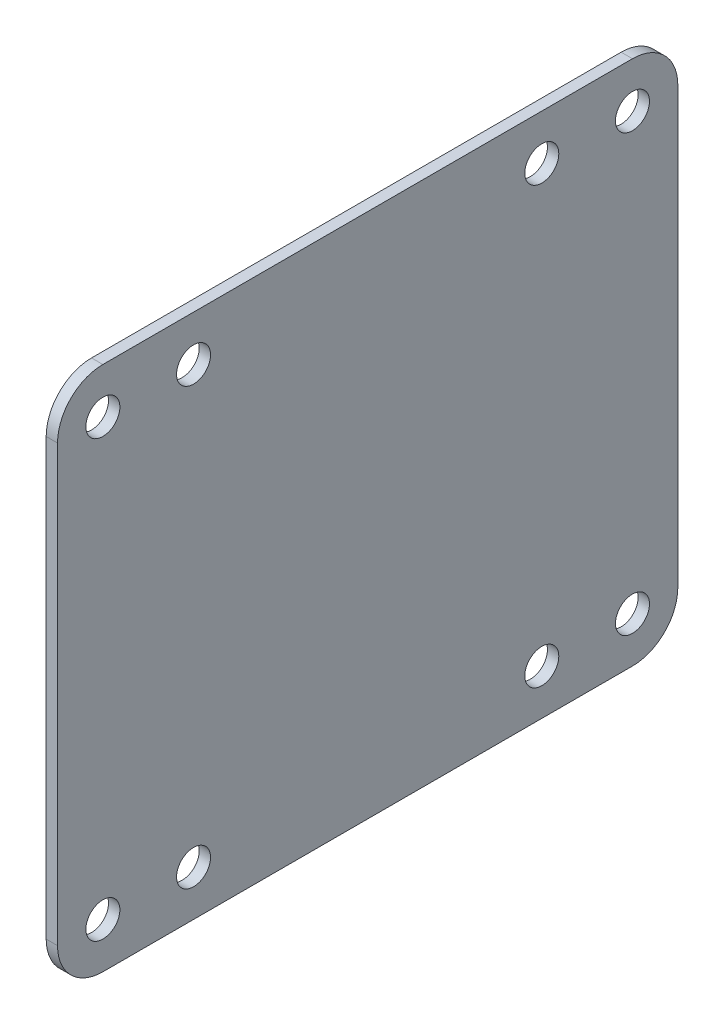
from build123d import *

# Parameters (mm, degrees)
SKETCH1_W           = 86.868
SKETCH1_H           = 73.66
SKETCH1_R           = 2.38125
BOSS_EXTRUDE1_DEPTH = 1.5875
FILLET1_R           = 6.35


with BuildPart() as part:
    # Sketch1 → Boss-Extrude1 (new body)
    with BuildSketch(Plane(origin=(0, 0, 0), x_dir=(0, 0, -1), z_dir=(1, 0, 0))):
        with Locations((24.384, -30.48)):
            Rectangle(SKETCH1_W, SKETCH1_H)
        Circle(SKETCH1_R, mode=Mode.SUBTRACT)
        with Locations((48.768, 0)):
            Circle(SKETCH1_R, mode=Mode.SUBTRACT)
        with Locations((48.768, -60.96)):
            Circle(SKETCH1_R, mode=Mode.SUBTRACT)
        with Locations((0, -60.96)):
            Circle(SKETCH1_R, mode=Mode.SUBTRACT)
        with Locations((-12.7, 0)):
            Circle(SKETCH1_R, mode=Mode.SUBTRACT)
        with Locations((61.468, 0)):
            Circle(SKETCH1_R, mode=Mode.SUBTRACT)
        with Locations((61.468, -60.96)):
            Circle(SKETCH1_R, mode=Mode.SUBTRACT)
        with Locations((-12.7, -60.96)):
            Circle(SKETCH1_R, mode=Mode.SUBTRACT)
    extrude(amount=BOSS_EXTRUDE1_DEPTH)

    # Fillet1
    fillet1_edges = [part.edges().sort_by_distance(p)[0] for p in [
        (0.79375, 6.35, 19.05),
        (0.79375, 6.35, -67.818),
        (0.79375, -67.31, -67.818),
        (0.79375, -67.31, 19.05),
    ]]
    fillet(fillet1_edges, radius=FILLET1_R)


solid = part.part
